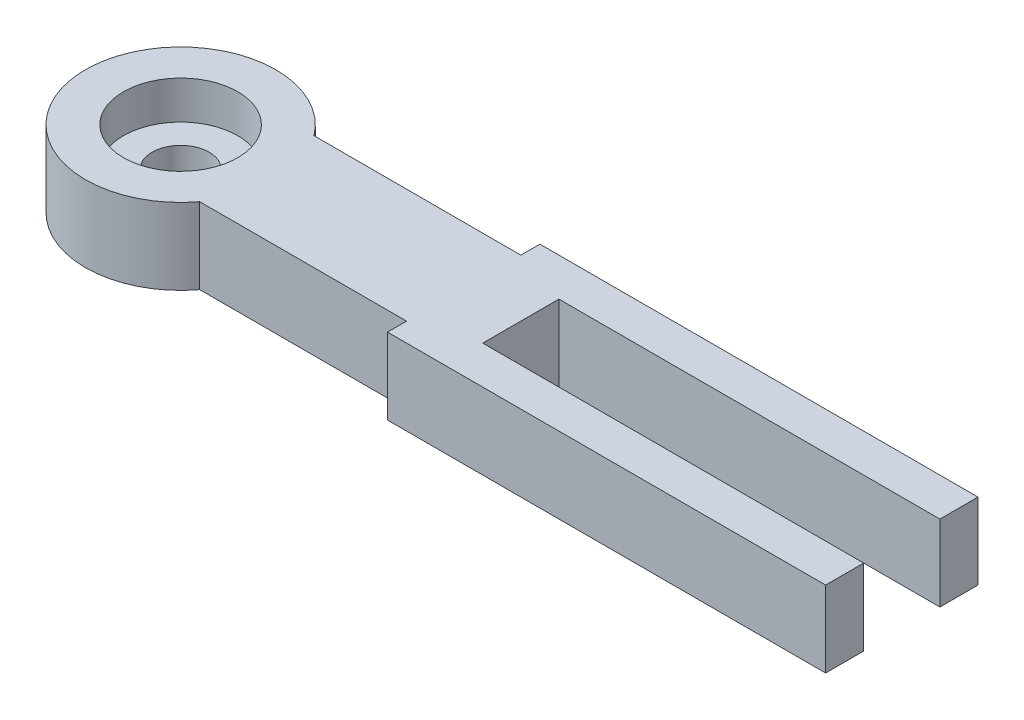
from build123d import *

# Parameters (mm, degrees)
ESBO_O1_R                = 1.5
RESSALTO_EXTRUS_O1_DEPTH = 4
CORTE_EXTRUS_O1_START    = -2
ESBO_O2_R                = 3
ESBO_O2_R_2              = 1.5
CORTE_EXTRUS_O1_DEPTH    = 2


with BuildPart() as part:
    # Esbo_o1 → Ressalto-extrus_o1 (new body)
    with BuildSketch(Plane(origin=(0, 0, 0), x_dir=(1, 0, 0), z_dir=(0, 1, 0))):
        with BuildLine():
            Line((62.101167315, 5.194552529), (62.101167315, 4.194552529))
            Line((62.101167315, 4.194552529), (62.101167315, 3.194552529))
            Line((62.101167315, 3.194552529), (39.101167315, 3.194552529))
            Line((39.101167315, 3.194552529), (39.101167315, 4.194552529))
            Line((39.101167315, 4.194552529), (28.24076646, 4.194552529))
            ThreePointArc((28.24076646, 4.194552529), (19.24076646, 7.194552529), (28.24076646, 10.194552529))
            Line((28.24076646, 10.194552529), (39.101167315, 10.194552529))
            Line((39.101167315, 10.194552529), (39.101167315, 11.194552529))
            Line((39.101167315, 11.194552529), (62.101167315, 11.194552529))
            Line((62.101167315, 11.194552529), (62.101167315, 10.194552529))
            Line((62.101167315, 10.194552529), (62.101167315, 9.194552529))
            Line((62.101167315, 9.194552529), (42.101167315, 9.194552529))
            Line((42.101167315, 9.194552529), (42.101167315, 5.194552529))
            Line((42.101167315, 5.194552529), (62.101167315, 5.194552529))
        make_face()
        with Locations(Location((24.24076646, 7.194552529, 0), (0, 0, 270))):
            Circle(ESBO_O1_R, mode=Mode.SUBTRACT)
    extrude(amount=RESSALTO_EXTRUS_O1_DEPTH)

    # Esbo_o2 → Corte-extrus_o1 (cut)
    with BuildSketch(Plane(origin=(0, 4, 0), x_dir=(1, 0, 0), z_dir=(0, 1, 0)).offset(CORTE_EXTRUS_O1_START)):
        with Locations(Location((24.24076646, 7.194552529, 0), (0, 0, 270))):
            Circle(ESBO_O2_R)
        with Locations(Location((24.24076646, 7.194552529, 0), (0, 0, 270))):
            Circle(ESBO_O2_R_2, mode=Mode.SUBTRACT)
    extrude(amount=CORTE_EXTRUS_O1_DEPTH, mode=Mode.SUBTRACT)


solid = part.part
